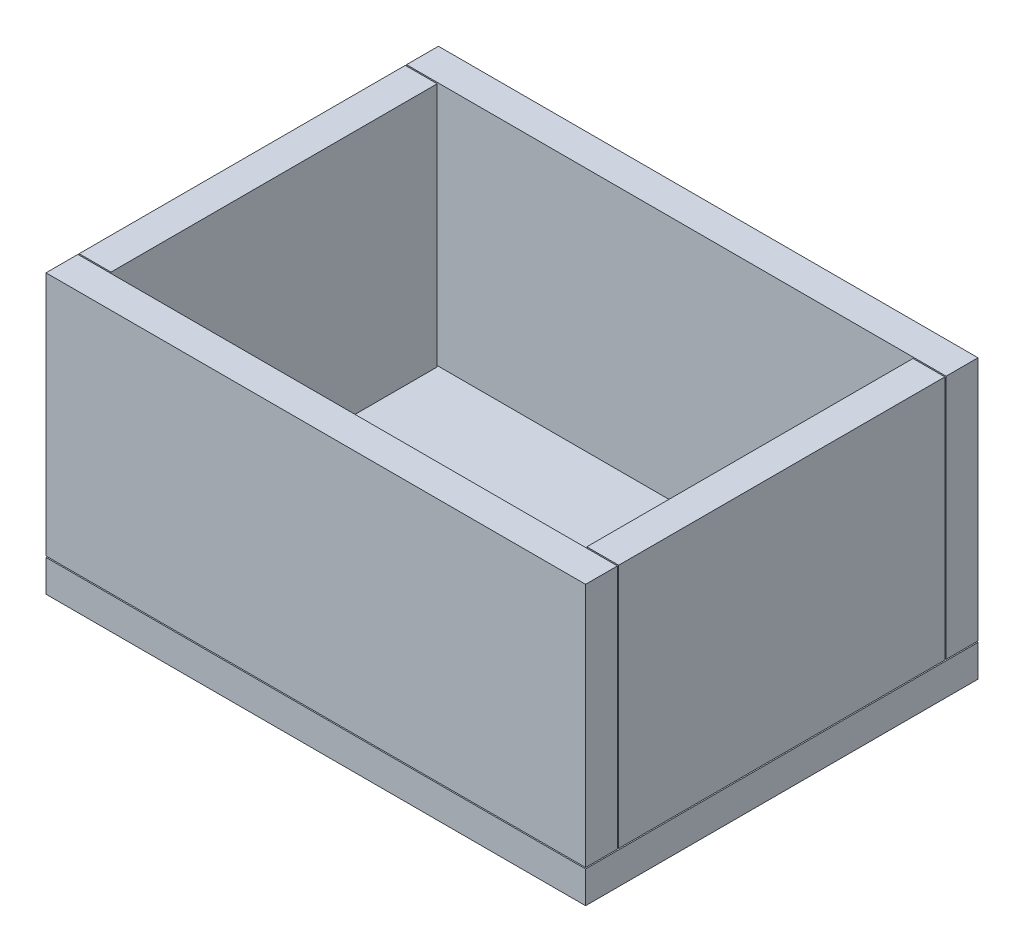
from build123d import *

# Parameters (mm, degrees)
SKETCH2_W             = 220
SKETCH2_H             = 160
BOSS_EXTRUDE1_DEPTH   = 13
BOSS_EXTRUDE3_START   = 0.5
SKETCH3_W             = 220
SKETCH3_H             = 13
BOSS_EXTRUDE3_DEPTH   = 100
BOSS_EXTRUDE3_2_DEPTH = 100
BOSS_EXTRUDE4_START   = 0.5
SKETCH4_W             = 13
SKETCH4_H             = 133
BOSS_EXTRUDE4_DEPTH   = 100
BOSS_EXTRUDE4_2_DEPTH = 100


with BuildPart() as part:
    # Sketch2 → Boss-Extrude1 (new body)
    with BuildSketch(Plane(origin=(0, 0, 0), x_dir=(1, 0, 0), z_dir=(0, 1, 0))):
        Rectangle(SKETCH2_W, SKETCH2_H)
    extrude(amount=BOSS_EXTRUDE1_DEPTH)


with BuildPart() as body_2:
    # Sketch3 → Boss-Extrude3 (new body)
    with BuildSketch(Plane(origin=(0, 13, 0), x_dir=(1, 0, 0), z_dir=(0, 1, 0)).offset(BOSS_EXTRUDE3_START)):
        with Locations((0, 73.5)):
            Rectangle(SKETCH3_W, SKETCH3_H)
    extrude(amount=BOSS_EXTRUDE3_DEPTH)


with BuildPart() as body_3:
    # Sketch3 → Boss-Extrude3 2 (new body)
    with BuildSketch(Plane(origin=(0, 13, 0), x_dir=(1, 0, 0), z_dir=(0, 1, 0)).offset(BOSS_EXTRUDE3_START)):
        with Locations((0, -73.5)):
            Rectangle(SKETCH3_W, SKETCH3_H)
    extrude(amount=BOSS_EXTRUDE3_2_DEPTH)


with BuildPart() as body_4:
    # Sketch4 → Boss-Extrude4 (new body)
    with BuildSketch(Plane(origin=(0, 13, 0), x_dir=(1, 0, 0), z_dir=(0, 1, 0)).offset(BOSS_EXTRUDE4_START)):
        with Locations((-103.5, 0)):
            Rectangle(SKETCH4_W, SKETCH4_H)
    extrude(amount=BOSS_EXTRUDE4_DEPTH)


with BuildPart() as body_5:
    # Sketch4 → Boss-Extrude4 2 (new body)
    with BuildSketch(Plane(origin=(0, 13, 0), x_dir=(1, 0, 0), z_dir=(0, 1, 0)).offset(BOSS_EXTRUDE4_START)):
        with Locations((103.5, 0)):
            Rectangle(SKETCH4_W, SKETCH4_H)
    extrude(amount=BOSS_EXTRUDE4_2_DEPTH)


solid = Compound([part.part, body_2.part, body_3.part, body_4.part, body_5.part])
